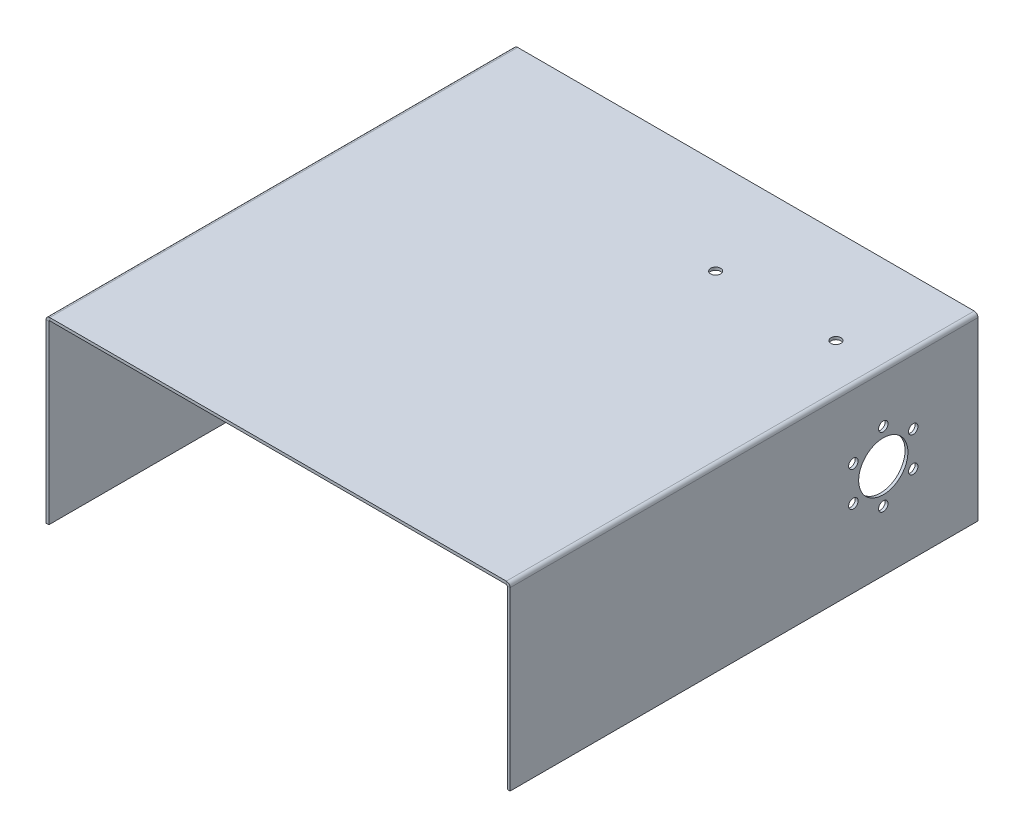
ISO-10303-21;
HEADER;
FILE_DESCRIPTION(('STEP AP214'),'2;1');
FILE_NAME('part.step','',(''),(''),'','','');
FILE_SCHEMA(('AUTOMOTIVE_DESIGN { 1 0 10303 214 1 1 1 1 }'));
ENDSEC;
DATA;
#1=APPLICATION_CONTEXT('core data for automotive mechanical design processes');
#2=APPLICATION_PROTOCOL_DEFINITION('international standard','automotive_design',2000,#1);
#3=PRODUCT_CONTEXT('',#1,'mechanical');
#4=PRODUCT('Part','Part','',(#3));
#5=PRODUCT_RELATED_PRODUCT_CATEGORY('part','',(#4));
#6=PRODUCT_DEFINITION_FORMATION('','',#4);
#7=PRODUCT_DEFINITION_CONTEXT('part definition',#1,'design');
#8=PRODUCT_DEFINITION('design','',#6,#7);
#9=PRODUCT_DEFINITION_SHAPE('','',#8);
#10=(LENGTH_UNIT() NAMED_UNIT(*) SI_UNIT(.MILLI.,.METRE.));
#11=(NAMED_UNIT(*) PLANE_ANGLE_UNIT() SI_UNIT($,.RADIAN.));
#12=(NAMED_UNIT(*) SI_UNIT($,.STERADIAN.) SOLID_ANGLE_UNIT());
#13=UNCERTAINTY_MEASURE_WITH_UNIT(LENGTH_MEASURE(1.E-05),#10,'distance_accuracy_value','');
#14=(GEOMETRIC_REPRESENTATION_CONTEXT(3) GLOBAL_UNCERTAINTY_ASSIGNED_CONTEXT((#13)) GLOBAL_UNIT_ASSIGNED_CONTEXT((#10,
#11,#12)) REPRESENTATION_CONTEXT('',''));
#15=CARTESIAN_POINT('',(0.,0.,0.));
#16=DIRECTION('',(0.,0.,1.));
#17=DIRECTION('',(1.,0.,0.));
#18=AXIS2_PLACEMENT_3D('',#15,#16,#17);
#19=CARTESIAN_POINT('',(-4.,190.,-494.));
#20=DIRECTION('',(0.,0.,-1.));
#21=DIRECTION('',(-1.,0.,0.));
#22=AXIS2_PLACEMENT_3D('',#19,#20,#21);
#23=PLANE('',#22);
#24=DIRECTION('',(0.,-1.,0.));
#25=VECTOR('',#24,1.);
#26=CARTESIAN_POINT('',(-4.,190.,-494.));
#27=LINE('',#26,#25);
#28=CARTESIAN_POINT('',(-4.,190.,-494.));
#29=VERTEX_POINT('',#28);
#30=CARTESIAN_POINT('',(-4.,187.,-494.));
#31=VERTEX_POINT('',#30);
#32=EDGE_CURVE('E11',#29,#31,#27,.T.);
#33=ORIENTED_EDGE('',*,*,#32,.F.);
#34=CARTESIAN_POINT('',(-4.,186.,-494.));
#35=DIRECTION('',(0.,0.,-1.));
#36=DIRECTION('',(-1.,0.,0.));
#37=AXIS2_PLACEMENT_3D('',#34,#35,#36);
#38=CIRCLE('',#37,4.);
#39=CARTESIAN_POINT('',(0.,186.,-494.));
#40=VERTEX_POINT('',#39);
#41=EDGE_CURVE('E204',#40,#29,#38,.F.);
#42=ORIENTED_EDGE('',*,*,#41,.F.);
#43=DIRECTION('',(1.,0.,0.));
#44=VECTOR('',#43,1.);
#45=CARTESIAN_POINT('',(-3.,186.,-494.));
#46=LINE('',#45,#44);
#47=CARTESIAN_POINT('',(-3.,186.,-494.));
#48=VERTEX_POINT('',#47);
#49=EDGE_CURVE('E41',#48,#40,#46,.T.);
#50=ORIENTED_EDGE('',*,*,#49,.F.);
#51=CARTESIAN_POINT('',(-4.,186.,-494.));
#52=DIRECTION('',(0.,0.,1.));
#53=DIRECTION('',(1.,0.,0.));
#54=AXIS2_PLACEMENT_3D('',#51,#52,#53);
#55=CIRCLE('',#54,1.);
#56=EDGE_CURVE('E193',#48,#31,#55,.T.);
#57=ORIENTED_EDGE('',*,*,#56,.T.);
#58=EDGE_LOOP('',(#33,#42,#50,#57));
#59=FACE_BOUND('',#58,.T.);
#60=ADVANCED_FACE('F33',(#59),#23,.T.);
#61=CARTESIAN_POINT('',(-3.,186.,-494.));
#62=DIRECTION('',(0.,0.,-1.));
#63=DIRECTION('',(-1.,0.,0.));
#64=AXIS2_PLACEMENT_3D('',#61,#62,#63);
#65=PLANE('',#64);
#66=DIRECTION('',(-1.,0.,0.));
#67=VECTOR('',#66,1.);
#68=CARTESIAN_POINT('',(0.,190.,-494.));
#69=LINE('',#68,#67);
#70=CARTESIAN_POINT('',(-486.,190.,-494.));
#71=VERTEX_POINT('',#70);
#72=EDGE_CURVE('E207',#29,#71,#69,.T.);
#73=ORIENTED_EDGE('',*,*,#72,.F.);
#74=ORIENTED_EDGE('',*,*,#32,.T.);
#75=DIRECTION('',(-1.,0.,0.));
#76=VECTOR('',#75,1.);
#77=CARTESIAN_POINT('',(0.,187.,-494.));
#78=LINE('',#77,#76);
#79=CARTESIAN_POINT('',(-486.,187.,-494.));
#80=VERTEX_POINT('',#79);
#81=EDGE_CURVE('E191',#31,#80,#78,.T.);
#82=ORIENTED_EDGE('',*,*,#81,.T.);
#83=DIRECTION('',(0.,1.,0.));
#84=VECTOR('',#83,1.);
#85=CARTESIAN_POINT('',(-486.,187.,-494.));
#86=LINE('',#85,#84);
#87=EDGE_CURVE('E57',#80,#71,#86,.T.);
#88=ORIENTED_EDGE('',*,*,#87,.T.);
#89=EDGE_LOOP('',(#73,#74,#82,#88));
#90=FACE_BOUND('',#89,.T.);
#91=ADVANCED_FACE('F344',(#90),#65,.T.);
#92=CARTESIAN_POINT('',(0.,186.,0.));
#93=DIRECTION('',(0.,0.,1.));
#94=DIRECTION('',(1.,0.,0.));
#95=AXIS2_PLACEMENT_3D('',#92,#93,#94);
#96=PLANE('',#95);
#97=DIRECTION('',(-1.,0.,0.));
#98=VECTOR('',#97,1.);
#99=CARTESIAN_POINT('',(0.,186.,0.));
#100=LINE('',#99,#98);
#101=CARTESIAN_POINT('',(0.,186.,0.));
#102=VERTEX_POINT('',#101);
#103=CARTESIAN_POINT('',(-3.,186.,0.));
#104=VERTEX_POINT('',#103);
#105=EDGE_CURVE('E248',#102,#104,#100,.T.);
#106=ORIENTED_EDGE('',*,*,#105,.F.);
#107=CARTESIAN_POINT('',(-4.,186.,0.));
#108=DIRECTION('',(0.,0.,-1.));
#109=DIRECTION('',(-1.,0.,0.));
#110=AXIS2_PLACEMENT_3D('',#107,#108,#109);
#111=CIRCLE('',#110,4.);
#112=CARTESIAN_POINT('',(-4.,190.,0.));
#113=VERTEX_POINT('',#112);
#114=EDGE_CURVE('E176',#102,#113,#111,.F.);
#115=ORIENTED_EDGE('',*,*,#114,.T.);
#116=DIRECTION('',(0.,1.,0.));
#117=VECTOR('',#116,1.);
#118=CARTESIAN_POINT('',(-4.,187.,0.));
#119=LINE('',#118,#117);
#120=CARTESIAN_POINT('',(-4.,187.,0.));
#121=VERTEX_POINT('',#120);
#122=EDGE_CURVE('E246',#121,#113,#119,.T.);
#123=ORIENTED_EDGE('',*,*,#122,.F.);
#124=CARTESIAN_POINT('',(-4.,186.,0.));
#125=DIRECTION('',(0.,0.,1.));
#126=DIRECTION('',(1.,0.,0.));
#127=AXIS2_PLACEMENT_3D('',#124,#125,#126);
#128=CIRCLE('',#127,1.);
#129=EDGE_CURVE('E165',#104,#121,#128,.T.);
#130=ORIENTED_EDGE('',*,*,#129,.F.);
#131=EDGE_LOOP('',(#106,#115,#123,#130));
#132=FACE_BOUND('',#131,.T.);
#133=ADVANCED_FACE('F346',(#132),#96,.T.);
#134=CARTESIAN_POINT('',(-4.,187.,0.));
#135=DIRECTION('',(0.,0.,1.));
#136=DIRECTION('',(1.,0.,0.));
#137=AXIS2_PLACEMENT_3D('',#134,#135,#136);
#138=PLANE('',#137);
#139=DIRECTION('',(0.,1.,0.));
#140=VECTOR('',#139,1.);
#141=CARTESIAN_POINT('',(0.,0.,0.));
#142=LINE('',#141,#140);
#143=CARTESIAN_POINT('',(0.,0.,0.));
#144=VERTEX_POINT('',#143);
#145=EDGE_CURVE('E173',#144,#102,#142,.T.);
#146=ORIENTED_EDGE('',*,*,#145,.T.);
#147=ORIENTED_EDGE('',*,*,#105,.T.);
#148=DIRECTION('',(0.,1.,0.));
#149=VECTOR('',#148,1.);
#150=CARTESIAN_POINT('',(-3.,0.,0.));
#151=LINE('',#150,#149);
#152=CARTESIAN_POINT('',(-3.,0.,0.));
#153=VERTEX_POINT('',#152);
#154=EDGE_CURVE('E168',#153,#104,#151,.T.);
#155=ORIENTED_EDGE('',*,*,#154,.F.);
#156=DIRECTION('',(-1.,0.,0.));
#157=VECTOR('',#156,1.);
#158=CARTESIAN_POINT('',(0.,0.,0.));
#159=LINE('',#158,#157);
#160=EDGE_CURVE('E171',#144,#153,#159,.T.);
#161=ORIENTED_EDGE('',*,*,#160,.F.);
#162=EDGE_LOOP('',(#146,#147,#155,#161));
#163=FACE_BOUND('',#162,.T.);
#164=ADVANCED_FACE('F324',(#163),#138,.T.);
#165=CARTESIAN_POINT('',(-490.,186.,-494.));
#166=DIRECTION('',(0.,0.,-1.));
#167=DIRECTION('',(-1.,0.,0.));
#168=AXIS2_PLACEMENT_3D('',#165,#166,#167);
#169=PLANE('',#168);
#170=DIRECTION('',(1.,0.,0.));
#171=VECTOR('',#170,1.);
#172=CARTESIAN_POINT('',(-490.,186.,-494.));
#173=LINE('',#172,#171);
#174=CARTESIAN_POINT('',(-490.,186.,-494.));
#175=VERTEX_POINT('',#174);
#176=CARTESIAN_POINT('',(-487.,186.,-494.));
#177=VERTEX_POINT('',#176);
#178=EDGE_CURVE('E49',#175,#177,#173,.T.);
#179=ORIENTED_EDGE('',*,*,#178,.F.);
#180=CARTESIAN_POINT('',(-486.,186.,-494.));
#181=DIRECTION('',(0.,0.,-1.));
#182=DIRECTION('',(-1.,0.,0.));
#183=AXIS2_PLACEMENT_3D('',#180,#181,#182);
#184=CIRCLE('',#183,4.);
#185=EDGE_CURVE('E136',#71,#175,#184,.F.);
#186=ORIENTED_EDGE('',*,*,#185,.F.);
#187=ORIENTED_EDGE('',*,*,#87,.F.);
#188=CARTESIAN_POINT('',(-486.,186.,-494.));
#189=DIRECTION('',(0.,0.,1.));
#190=DIRECTION('',(1.,0.,0.));
#191=AXIS2_PLACEMENT_3D('',#188,#189,#190);
#192=CIRCLE('',#191,1.);
#193=EDGE_CURVE('E189',#80,#177,#192,.T.);
#194=ORIENTED_EDGE('',*,*,#193,.T.);
#195=EDGE_LOOP('',(#179,#186,#187,#194));
#196=FACE_BOUND('',#195,.T.);
#197=ADVANCED_FACE('F356',(#196),#169,.T.);
#198=CARTESIAN_POINT('',(-486.,187.,-494.));
#199=DIRECTION('',(0.,0.,-1.));
#200=DIRECTION('',(-1.,0.,0.));
#201=AXIS2_PLACEMENT_3D('',#198,#199,#200);
#202=PLANE('',#201);
#203=DIRECTION('',(0.,-1.,0.));
#204=VECTOR('',#203,1.);
#205=CARTESIAN_POINT('',(-490.,190.,-494.));
#206=LINE('',#205,#204);
#207=CARTESIAN_POINT('',(-490.,0.,-494.));
#208=VERTEX_POINT('',#207);
#209=EDGE_CURVE('E132',#175,#208,#206,.T.);
#210=ORIENTED_EDGE('',*,*,#209,.F.);
#211=ORIENTED_EDGE('',*,*,#178,.T.);
#212=DIRECTION('',(0.,1.,0.));
#213=VECTOR('',#212,1.);
#214=CARTESIAN_POINT('',(-487.,190.,-494.));
#215=LINE('',#214,#213);
#216=CARTESIAN_POINT('',(-487.,0.,-494.));
#217=VERTEX_POINT('',#216);
#218=EDGE_CURVE('E187',#177,#217,#215,.F.);
#219=ORIENTED_EDGE('',*,*,#218,.T.);
#220=DIRECTION('',(-1.,0.,0.));
#221=VECTOR('',#220,1.);
#222=CARTESIAN_POINT('',(-487.,0.,-494.));
#223=LINE('',#222,#221);
#224=EDGE_CURVE('E185',#217,#208,#223,.T.);
#225=ORIENTED_EDGE('',*,*,#224,.T.);
#226=EDGE_LOOP('',(#210,#211,#219,#225));
#227=FACE_BOUND('',#226,.T.);
#228=ADVANCED_FACE('F359',(#227),#202,.T.);
#229=CARTESIAN_POINT('',(-486.,190.,0.));
#230=DIRECTION('',(0.,0.,1.));
#231=DIRECTION('',(1.,0.,0.));
#232=AXIS2_PLACEMENT_3D('',#229,#230,#231);
#233=PLANE('',#232);
#234=DIRECTION('',(0.,-1.,0.));
#235=VECTOR('',#234,1.);
#236=CARTESIAN_POINT('',(-486.,190.,0.));
#237=LINE('',#236,#235);
#238=CARTESIAN_POINT('',(-486.,190.,0.));
#239=VERTEX_POINT('',#238);
#240=CARTESIAN_POINT('',(-486.,187.,0.));
#241=VERTEX_POINT('',#240);
#242=EDGE_CURVE('E242',#239,#241,#237,.T.);
#243=ORIENTED_EDGE('',*,*,#242,.F.);
#244=CARTESIAN_POINT('',(-486.,186.,0.));
#245=DIRECTION('',(0.,0.,-1.));
#246=DIRECTION('',(-1.,0.,0.));
#247=AXIS2_PLACEMENT_3D('',#244,#245,#246);
#248=CIRCLE('',#247,4.);
#249=CARTESIAN_POINT('',(-490.,186.,0.));
#250=VERTEX_POINT('',#249);
#251=EDGE_CURVE('E182',#239,#250,#248,.F.);
#252=ORIENTED_EDGE('',*,*,#251,.T.);
#253=DIRECTION('',(-1.,0.,0.));
#254=VECTOR('',#253,1.);
#255=CARTESIAN_POINT('',(-487.,186.,0.));
#256=LINE('',#255,#254);
#257=CARTESIAN_POINT('',(-487.,186.,0.));
#258=VERTEX_POINT('',#257);
#259=EDGE_CURVE('E148',#258,#250,#256,.T.);
#260=ORIENTED_EDGE('',*,*,#259,.F.);
#261=CARTESIAN_POINT('',(-486.,186.,0.));
#262=DIRECTION('',(0.,0.,1.));
#263=DIRECTION('',(1.,0.,0.));
#264=AXIS2_PLACEMENT_3D('',#261,#262,#263);
#265=CIRCLE('',#264,1.);
#266=EDGE_CURVE('E159',#241,#258,#265,.T.);
#267=ORIENTED_EDGE('',*,*,#266,.F.);
#268=EDGE_LOOP('',(#243,#252,#260,#267));
#269=FACE_BOUND('',#268,.T.);
#270=ADVANCED_FACE('F362',(#269),#233,.T.);
#271=CARTESIAN_POINT('',(-487.,186.,0.));
#272=DIRECTION('',(0.,0.,1.));
#273=DIRECTION('',(1.,0.,0.));
#274=AXIS2_PLACEMENT_3D('',#271,#272,#273);
#275=PLANE('',#274);
#276=DIRECTION('',(-1.,0.,0.));
#277=VECTOR('',#276,1.);
#278=CARTESIAN_POINT('',(0.,190.,0.));
#279=LINE('',#278,#277);
#280=EDGE_CURVE('E179',#113,#239,#279,.T.);
#281=ORIENTED_EDGE('',*,*,#280,.T.);
#282=ORIENTED_EDGE('',*,*,#242,.T.);
#283=DIRECTION('',(-1.,0.,0.));
#284=VECTOR('',#283,1.);
#285=CARTESIAN_POINT('',(0.,187.,0.));
#286=LINE('',#285,#284);
#287=EDGE_CURVE('E162',#121,#241,#286,.T.);
#288=ORIENTED_EDGE('',*,*,#287,.F.);
#289=ORIENTED_EDGE('',*,*,#122,.T.);
#290=EDGE_LOOP('',(#281,#282,#288,#289));
#291=FACE_BOUND('',#290,.T.);
#292=ADVANCED_FACE('F366',(#291),#275,.T.);
#293=CARTESIAN_POINT('',(-490.,190.,-494.));
#294=DIRECTION('',(-1.,0.,0.));
#295=DIRECTION('',(0.,0.,1.));
#296=AXIS2_PLACEMENT_3D('',#293,#294,#295);
#297=PLANE('',#296);
#298=CARTESIAN_POINT('',(-490.,99.9999999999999,-394.));
#299=DIRECTION('',(-1.,0.,0.));
#300=DIRECTION('',(0.,0.,1.));
#301=AXIS2_PLACEMENT_3D('',#298,#299,#300);
#302=CIRCLE('',#301,15.);
#303=CARTESIAN_POINT('',(-490.,99.9999999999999,-379.));
#304=VERTEX_POINT('',#303);
#305=EDGE_CURVE('E290',#304,#304,#302,.T.);
#306=ORIENTED_EDGE('',*,*,#305,.F.);
#307=EDGE_LOOP('',(#306));
#308=FACE_BOUND('',#307,.T.);
#309=DIRECTION('',(0.,-1.,0.));
#310=VECTOR('',#309,1.);
#311=CARTESIAN_POINT('',(-490.,190.,0.));
#312=LINE('',#311,#310);
#313=CARTESIAN_POINT('',(-490.,0.,0.));
#314=VERTEX_POINT('',#313);
#315=EDGE_CURVE('E129',#250,#314,#312,.T.);
#316=ORIENTED_EDGE('',*,*,#315,.F.);
#317=DIRECTION('',(0.,0.,1.));
#318=VECTOR('',#317,1.);
#319=CARTESIAN_POINT('',(-490.,186.,-494.));
#320=LINE('',#319,#318);
#321=EDGE_CURVE('E212',#175,#250,#320,.T.);
#322=ORIENTED_EDGE('',*,*,#321,.F.);
#323=ORIENTED_EDGE('',*,*,#209,.T.);
#324=DIRECTION('',(0.,0.,1.));
#325=VECTOR('',#324,1.);
#326=CARTESIAN_POINT('',(-490.,0.,-494.));
#327=LINE('',#326,#325);
#328=EDGE_CURVE('E125',#208,#314,#327,.T.);
#329=ORIENTED_EDGE('',*,*,#328,.T.);
#330=EDGE_LOOP('',(#316,#322,#323,#329));
#331=FACE_BOUND('',#330,.T.);
#332=ADVANCED_FACE('F127',(#308,#331),#297,.T.);
#333=CARTESIAN_POINT('',(-486.,186.,-494.));
#334=DIRECTION('',(0.,0.,1.));
#335=DIRECTION('',(1.,0.,0.));
#336=AXIS2_PLACEMENT_3D('',#333,#334,#335);
#337=CYLINDRICAL_SURFACE('',#336,4.);
#338=ORIENTED_EDGE('',*,*,#251,.F.);
#339=DIRECTION('',(0.,0.,1.));
#340=VECTOR('',#339,1.);
#341=CARTESIAN_POINT('',(-486.,190.,-494.));
#342=LINE('',#341,#340);
#343=EDGE_CURVE('E214',#71,#239,#342,.T.);
#344=ORIENTED_EDGE('',*,*,#343,.F.);
#345=ORIENTED_EDGE('',*,*,#185,.T.);
#346=ORIENTED_EDGE('',*,*,#321,.T.);
#347=EDGE_LOOP('',(#338,#344,#345,#346));
#348=FACE_BOUND('',#347,.T.);
#349=ADVANCED_FACE('F373',(#348),#337,.T.);
#350=CARTESIAN_POINT('',(0.,190.,-494.));
#351=DIRECTION('',(0.,1.,0.));
#352=DIRECTION('',(-1.,0.,0.));
#353=AXIS2_PLACEMENT_3D('',#350,#351,#352);
#354=PLANE('',#353);
#355=CARTESIAN_POINT('',(-177.,190.,-394.));
#356=DIRECTION('',(0.,1.,0.));
#357=DIRECTION('',(-1.,0.,0.));
#358=AXIS2_PLACEMENT_3D('',#355,#356,#357);
#359=CIRCLE('',#358,5.25);
#360=CARTESIAN_POINT('',(-182.25,190.,-394.));
#361=VERTEX_POINT('',#360);
#362=EDGE_CURVE('E280',#361,#361,#359,.T.);
#363=ORIENTED_EDGE('',*,*,#362,.F.);
#364=EDGE_LOOP('',(#363));
#365=FACE_BOUND('',#364,.T.);
#366=CARTESIAN_POINT('',(-50.,190.,-394.));
#367=DIRECTION('',(0.,1.,0.));
#368=DIRECTION('',(-1.,0.,0.));
#369=AXIS2_PLACEMENT_3D('',#366,#367,#368);
#370=CIRCLE('',#369,5.25);
#371=CARTESIAN_POINT('',(-55.25,190.,-394.));
#372=VERTEX_POINT('',#371);
#373=EDGE_CURVE('E277',#372,#372,#370,.T.);
#374=ORIENTED_EDGE('',*,*,#373,.F.);
#375=EDGE_LOOP('',(#374));
#376=FACE_BOUND('',#375,.T.);
#377=ORIENTED_EDGE('',*,*,#280,.F.);
#378=DIRECTION('',(0.,0.,1.));
#379=VECTOR('',#378,1.);
#380=CARTESIAN_POINT('',(-4.,190.,-494.));
#381=LINE('',#380,#379);
#382=EDGE_CURVE('E217',#29,#113,#381,.T.);
#383=ORIENTED_EDGE('',*,*,#382,.F.);
#384=ORIENTED_EDGE('',*,*,#72,.T.);
#385=ORIENTED_EDGE('',*,*,#343,.T.);
#386=EDGE_LOOP('',(#377,#383,#384,#385));
#387=FACE_BOUND('',#386,.T.);
#388=ADVANCED_FACE('F343',(#365,#376,#387),#354,.T.);
#389=CARTESIAN_POINT('',(-4.,186.,-494.));
#390=DIRECTION('',(0.,0.,1.));
#391=DIRECTION('',(1.,0.,0.));
#392=AXIS2_PLACEMENT_3D('',#389,#390,#391);
#393=CYLINDRICAL_SURFACE('',#392,4.);
#394=ORIENTED_EDGE('',*,*,#114,.F.);
#395=DIRECTION('',(0.,0.,1.));
#396=VECTOR('',#395,1.);
#397=CARTESIAN_POINT('',(0.,186.,-494.));
#398=LINE('',#397,#396);
#399=EDGE_CURVE('E220',#40,#102,#398,.T.);
#400=ORIENTED_EDGE('',*,*,#399,.F.);
#401=ORIENTED_EDGE('',*,*,#41,.T.);
#402=ORIENTED_EDGE('',*,*,#382,.T.);
#403=EDGE_LOOP('',(#394,#400,#401,#402));
#404=FACE_BOUND('',#403,.T.);
#405=ADVANCED_FACE('F312',(#404),#393,.T.);
#406=CARTESIAN_POINT('',(0.,0.,-494.));
#407=DIRECTION('',(1.,0.,0.));
#408=DIRECTION('',(0.,0.,-1.));
#409=AXIS2_PLACEMENT_3D('',#406,#407,#408);
#410=PLANE('',#409);
#411=CARTESIAN_POINT('',(0.,118.249999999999,-362.390072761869));
#412=DIRECTION('',(1.,0.,0.));
#413=DIRECTION('',(0.,0.,-1.));
#414=AXIS2_PLACEMENT_3D('',#411,#412,#413);
#415=CIRCLE('',#414,5.);
#416=CARTESIAN_POINT('',(0.,118.249999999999,-367.390072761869));
#417=VERTEX_POINT('',#416);
#418=EDGE_CURVE('E274',#417,#417,#415,.T.);
#419=ORIENTED_EDGE('',*,*,#418,.F.);
#420=EDGE_LOOP('',(#419));
#421=FACE_BOUND('',#420,.T.);
#422=CARTESIAN_POINT('',(0.,81.749999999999,-362.39007276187));
#423=DIRECTION('',(1.,0.,0.));
#424=DIRECTION('',(0.,0.,-1.));
#425=AXIS2_PLACEMENT_3D('',#422,#423,#424);
#426=CIRCLE('',#425,5.00000000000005);
#427=CARTESIAN_POINT('',(0.,81.749999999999,-367.39007276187));
#428=VERTEX_POINT('',#427);
#429=EDGE_CURVE('E270',#428,#428,#426,.T.);
#430=ORIENTED_EDGE('',*,*,#429,.F.);
#431=EDGE_LOOP('',(#430));
#432=FACE_BOUND('',#431,.T.);
#433=CARTESIAN_POINT('',(0.,63.5,-394.000000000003));
#434=DIRECTION('',(1.,0.,0.));
#435=DIRECTION('',(0.,0.,-1.));
#436=AXIS2_PLACEMENT_3D('',#433,#434,#435);
#437=CIRCLE('',#436,4.99999999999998);
#438=CARTESIAN_POINT('',(0.,63.5,-399.000000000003));
#439=VERTEX_POINT('',#438);
#440=EDGE_CURVE('E266',#439,#439,#437,.T.);
#441=ORIENTED_EDGE('',*,*,#440,.F.);
#442=EDGE_LOOP('',(#441));
#443=FACE_BOUND('',#442,.T.);
#444=CARTESIAN_POINT('',(0.,81.7500000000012,-425.609927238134));
#445=DIRECTION('',(1.,0.,0.));
#446=DIRECTION('',(0.,0.,-1.));
#447=AXIS2_PLACEMENT_3D('',#444,#445,#446);
#448=CIRCLE('',#447,5.00000000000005);
#449=CARTESIAN_POINT('',(0.,81.7500000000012,-430.609927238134));
#450=VERTEX_POINT('',#449);
#451=EDGE_CURVE('E262',#450,#450,#448,.T.);
#452=ORIENTED_EDGE('',*,*,#451,.F.);
#453=EDGE_LOOP('',(#452));
#454=FACE_BOUND('',#453,.T.);
#455=CARTESIAN_POINT('',(0.,118.250000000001,-425.609927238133));
#456=DIRECTION('',(1.,0.,0.));
#457=DIRECTION('',(0.,0.,-1.));
#458=AXIS2_PLACEMENT_3D('',#455,#456,#457);
#459=CIRCLE('',#458,5.00000000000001);
#460=CARTESIAN_POINT('',(0.,118.250000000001,-430.609927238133));
#461=VERTEX_POINT('',#460);
#462=EDGE_CURVE('E258',#461,#461,#459,.T.);
#463=ORIENTED_EDGE('',*,*,#462,.F.);
#464=EDGE_LOOP('',(#463));
#465=FACE_BOUND('',#464,.T.);
#466=CARTESIAN_POINT('',(0.,136.5,-394.));
#467=DIRECTION('',(1.,0.,0.));
#468=DIRECTION('',(0.,0.,-1.));
#469=AXIS2_PLACEMENT_3D('',#466,#467,#468);
#470=CIRCLE('',#469,4.99999999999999);
#471=CARTESIAN_POINT('',(0.,136.5,-399.));
#472=VERTEX_POINT('',#471);
#473=EDGE_CURVE('E254',#472,#472,#470,.T.);
#474=ORIENTED_EDGE('',*,*,#473,.F.);
#475=EDGE_LOOP('',(#474));
#476=FACE_BOUND('',#475,.T.);
#477=CARTESIAN_POINT('',(0.,100.,-394.));
#478=DIRECTION('',(1.,0.,0.));
#479=DIRECTION('',(0.,0.,-1.));
#480=AXIS2_PLACEMENT_3D('',#477,#478,#479);
#481=CIRCLE('',#480,26.);
#482=CARTESIAN_POINT('',(0.,100.,-420.));
#483=VERTEX_POINT('',#482);
#484=EDGE_CURVE('E153',#483,#483,#481,.T.);
#485=ORIENTED_EDGE('',*,*,#484,.F.);
#486=EDGE_LOOP('',(#485));
#487=FACE_BOUND('',#486,.T.);
#488=ORIENTED_EDGE('',*,*,#145,.F.);
#489=DIRECTION('',(0.,0.,1.));
#490=VECTOR('',#489,1.);
#491=CARTESIAN_POINT('',(0.,0.,-494.));
#492=LINE('',#491,#490);
#493=CARTESIAN_POINT('',(0.,0.,-494.));
#494=VERTEX_POINT('',#493);
#495=EDGE_CURVE('E223',#494,#144,#492,.T.);
#496=ORIENTED_EDGE('',*,*,#495,.F.);
#497=DIRECTION('',(0.,1.,0.));
#498=VECTOR('',#497,1.);
#499=CARTESIAN_POINT('',(0.,0.,-494.));
#500=LINE('',#499,#498);
#501=EDGE_CURVE('E201',#494,#40,#500,.T.);
#502=ORIENTED_EDGE('',*,*,#501,.T.);
#503=ORIENTED_EDGE('',*,*,#399,.T.);
#504=EDGE_LOOP('',(#488,#496,#502,#503));
#505=FACE_BOUND('',#504,.T.);
#506=ADVANCED_FACE('F308',(#421,#432,#443,#454,#465,#476,#487,#505),#410,.T.);
#507=CARTESIAN_POINT('',(0.,0.,-494.));
#508=DIRECTION('',(0.,1.,0.));
#509=DIRECTION('',(0.,0.,1.));
#510=AXIS2_PLACEMENT_3D('',#507,#508,#509);
#511=PLANE('',#510);
#512=ORIENTED_EDGE('',*,*,#160,.T.);
#513=DIRECTION('',(0.,0.,1.));
#514=VECTOR('',#513,1.);
#515=CARTESIAN_POINT('',(-3.,0.,-494.));
#516=LINE('',#515,#514);
#517=CARTESIAN_POINT('',(-3.,0.,-494.));
#518=VERTEX_POINT('',#517);
#519=EDGE_CURVE('E225',#518,#153,#516,.T.);
#520=ORIENTED_EDGE('',*,*,#519,.F.);
#521=DIRECTION('',(-1.,0.,0.));
#522=VECTOR('',#521,1.);
#523=CARTESIAN_POINT('',(0.,0.,-494.));
#524=LINE('',#523,#522);
#525=EDGE_CURVE('E199',#494,#518,#524,.T.);
#526=ORIENTED_EDGE('',*,*,#525,.F.);
#527=ORIENTED_EDGE('',*,*,#495,.T.);
#528=EDGE_LOOP('',(#512,#520,#526,#527));
#529=FACE_BOUND('',#528,.T.);
#530=ADVANCED_FACE('F311',(#529),#511,.F.);
#531=CARTESIAN_POINT('',(-3.,0.,-494.));
#532=DIRECTION('',(1.,0.,0.));
#533=DIRECTION('',(0.,0.,-1.));
#534=AXIS2_PLACEMENT_3D('',#531,#532,#533);
#535=PLANE('',#534);
#536=CARTESIAN_POINT('',(-3.,118.249999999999,-362.390072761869));
#537=DIRECTION('',(1.,0.,0.));
#538=DIRECTION('',(0.,0.,-1.));
#539=AXIS2_PLACEMENT_3D('',#536,#537,#538);
#540=CIRCLE('',#539,5.);
#541=CARTESIAN_POINT('',(-3.,118.249999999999,-367.390072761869));
#542=VERTEX_POINT('',#541);
#543=EDGE_CURVE('E271',#542,#542,#540,.T.);
#544=ORIENTED_EDGE('',*,*,#543,.T.);
#545=EDGE_LOOP('',(#544));
#546=FACE_BOUND('',#545,.T.);
#547=CARTESIAN_POINT('',(-3.,81.749999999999,-362.39007276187));
#548=DIRECTION('',(1.,0.,0.));
#549=DIRECTION('',(0.,0.,-1.));
#550=AXIS2_PLACEMENT_3D('',#547,#548,#549);
#551=CIRCLE('',#550,5.00000000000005);
#552=CARTESIAN_POINT('',(-3.,81.749999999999,-367.39007276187));
#553=VERTEX_POINT('',#552);
#554=EDGE_CURVE('E267',#553,#553,#551,.T.);
#555=ORIENTED_EDGE('',*,*,#554,.T.);
#556=EDGE_LOOP('',(#555));
#557=FACE_BOUND('',#556,.T.);
#558=CARTESIAN_POINT('',(-3.,63.5,-394.000000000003));
#559=DIRECTION('',(1.,0.,0.));
#560=DIRECTION('',(0.,0.,-1.));
#561=AXIS2_PLACEMENT_3D('',#558,#559,#560);
#562=CIRCLE('',#561,4.99999999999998);
#563=CARTESIAN_POINT('',(-3.,63.5,-399.000000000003));
#564=VERTEX_POINT('',#563);
#565=EDGE_CURVE('E263',#564,#564,#562,.T.);
#566=ORIENTED_EDGE('',*,*,#565,.T.);
#567=EDGE_LOOP('',(#566));
#568=FACE_BOUND('',#567,.T.);
#569=CARTESIAN_POINT('',(-3.,81.7500000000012,-425.609927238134));
#570=DIRECTION('',(1.,0.,0.));
#571=DIRECTION('',(0.,0.,-1.));
#572=AXIS2_PLACEMENT_3D('',#569,#570,#571);
#573=CIRCLE('',#572,5.00000000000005);
#574=CARTESIAN_POINT('',(-3.,81.7500000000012,-430.609927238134));
#575=VERTEX_POINT('',#574);
#576=EDGE_CURVE('E259',#575,#575,#573,.T.);
#577=ORIENTED_EDGE('',*,*,#576,.T.);
#578=EDGE_LOOP('',(#577));
#579=FACE_BOUND('',#578,.T.);
#580=CARTESIAN_POINT('',(-3.,118.250000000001,-425.609927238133));
#581=DIRECTION('',(1.,0.,0.));
#582=DIRECTION('',(0.,0.,-1.));
#583=AXIS2_PLACEMENT_3D('',#580,#581,#582);
#584=CIRCLE('',#583,5.00000000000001);
#585=CARTESIAN_POINT('',(-3.,118.250000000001,-430.609927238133));
#586=VERTEX_POINT('',#585);
#587=EDGE_CURVE('E255',#586,#586,#584,.T.);
#588=ORIENTED_EDGE('',*,*,#587,.T.);
#589=EDGE_LOOP('',(#588));
#590=FACE_BOUND('',#589,.T.);
#591=CARTESIAN_POINT('',(-3.,136.5,-394.));
#592=DIRECTION('',(1.,0.,0.));
#593=DIRECTION('',(0.,0.,-1.));
#594=AXIS2_PLACEMENT_3D('',#591,#592,#593);
#595=CIRCLE('',#594,4.99999999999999);
#596=CARTESIAN_POINT('',(-3.,136.5,-399.));
#597=VERTEX_POINT('',#596);
#598=EDGE_CURVE('E251',#597,#597,#595,.T.);
#599=ORIENTED_EDGE('',*,*,#598,.T.);
#600=EDGE_LOOP('',(#599));
#601=FACE_BOUND('',#600,.T.);
#602=CARTESIAN_POINT('',(-3.,100.,-394.));
#603=DIRECTION('',(1.,0.,0.));
#604=DIRECTION('',(0.,0.,-1.));
#605=AXIS2_PLACEMENT_3D('',#602,#603,#604);
#606=CIRCLE('',#605,26.);
#607=CARTESIAN_POINT('',(-3.,100.,-420.));
#608=VERTEX_POINT('',#607);
#609=EDGE_CURVE('E150',#608,#608,#606,.T.);
#610=ORIENTED_EDGE('',*,*,#609,.T.);
#611=EDGE_LOOP('',(#610));
#612=FACE_BOUND('',#611,.T.);
#613=ORIENTED_EDGE('',*,*,#154,.T.);
#614=DIRECTION('',(0.,0.,1.));
#615=VECTOR('',#614,1.);
#616=CARTESIAN_POINT('',(-3.,186.,-494.));
#617=LINE('',#616,#615);
#618=EDGE_CURVE('E228',#48,#104,#617,.T.);
#619=ORIENTED_EDGE('',*,*,#618,.F.);
#620=DIRECTION('',(0.,1.,0.));
#621=VECTOR('',#620,1.);
#622=CARTESIAN_POINT('',(-3.,0.,-494.));
#623=LINE('',#622,#621);
#624=EDGE_CURVE('E196',#518,#48,#623,.T.);
#625=ORIENTED_EDGE('',*,*,#624,.F.);
#626=ORIENTED_EDGE('',*,*,#519,.T.);
#627=EDGE_LOOP('',(#613,#619,#625,#626));
#628=FACE_BOUND('',#627,.T.);
#629=ADVANCED_FACE('F330',(#546,#557,#568,#579,#590,#601,#612,#628),#535,.F.);
#630=CARTESIAN_POINT('',(-4.,186.,-494.));
#631=DIRECTION('',(0.,0.,1.));
#632=DIRECTION('',(1.,0.,0.));
#633=AXIS2_PLACEMENT_3D('',#630,#631,#632);
#634=CYLINDRICAL_SURFACE('',#633,1.);
#635=ORIENTED_EDGE('',*,*,#129,.T.);
#636=DIRECTION('',(0.,0.,1.));
#637=VECTOR('',#636,1.);
#638=CARTESIAN_POINT('',(-4.,187.,-494.));
#639=LINE('',#638,#637);
#640=EDGE_CURVE('E231',#31,#121,#639,.T.);
#641=ORIENTED_EDGE('',*,*,#640,.F.);
#642=ORIENTED_EDGE('',*,*,#56,.F.);
#643=ORIENTED_EDGE('',*,*,#618,.T.);
#644=EDGE_LOOP('',(#635,#641,#642,#643));
#645=FACE_BOUND('',#644,.T.);
#646=ADVANCED_FACE('F388',(#645),#634,.F.);
#647=CARTESIAN_POINT('',(0.,187.,-494.));
#648=DIRECTION('',(0.,1.,0.));
#649=DIRECTION('',(-1.,0.,0.));
#650=AXIS2_PLACEMENT_3D('',#647,#648,#649);
#651=PLANE('',#650);
#652=CARTESIAN_POINT('',(-177.,187.,-394.));
#653=DIRECTION('',(0.,1.,0.));
#654=DIRECTION('',(-1.,0.,0.));
#655=AXIS2_PLACEMENT_3D('',#652,#653,#654);
#656=CIRCLE('',#655,5.25);
#657=CARTESIAN_POINT('',(-182.25,187.,-394.));
#658=VERTEX_POINT('',#657);
#659=EDGE_CURVE('E278',#658,#658,#656,.T.);
#660=ORIENTED_EDGE('',*,*,#659,.T.);
#661=EDGE_LOOP('',(#660));
#662=FACE_BOUND('',#661,.T.);
#663=CARTESIAN_POINT('',(-50.,187.,-394.));
#664=DIRECTION('',(0.,1.,0.));
#665=DIRECTION('',(-1.,0.,0.));
#666=AXIS2_PLACEMENT_3D('',#663,#664,#665);
#667=CIRCLE('',#666,5.25);
#668=CARTESIAN_POINT('',(-55.25,187.,-394.));
#669=VERTEX_POINT('',#668);
#670=EDGE_CURVE('E275',#669,#669,#667,.T.);
#671=ORIENTED_EDGE('',*,*,#670,.T.);
#672=EDGE_LOOP('',(#671));
#673=FACE_BOUND('',#672,.T.);
#674=ORIENTED_EDGE('',*,*,#287,.T.);
#675=DIRECTION('',(0.,0.,1.));
#676=VECTOR('',#675,1.);
#677=CARTESIAN_POINT('',(-486.,187.,-494.));
#678=LINE('',#677,#676);
#679=EDGE_CURVE('E234',#80,#241,#678,.T.);
#680=ORIENTED_EDGE('',*,*,#679,.F.);
#681=ORIENTED_EDGE('',*,*,#81,.F.);
#682=ORIENTED_EDGE('',*,*,#640,.T.);
#683=EDGE_LOOP('',(#674,#680,#681,#682));
#684=FACE_BOUND('',#683,.T.);
#685=ADVANCED_FACE('F384',(#662,#673,#684),#651,.F.);
#686=CARTESIAN_POINT('',(-486.,186.,-494.));
#687=DIRECTION('',(0.,0.,1.));
#688=DIRECTION('',(1.,0.,0.));
#689=AXIS2_PLACEMENT_3D('',#686,#687,#688);
#690=CYLINDRICAL_SURFACE('',#689,1.);
#691=ORIENTED_EDGE('',*,*,#266,.T.);
#692=DIRECTION('',(0.,0.,1.));
#693=VECTOR('',#692,1.);
#694=CARTESIAN_POINT('',(-487.,186.,-494.));
#695=LINE('',#694,#693);
#696=EDGE_CURVE('E237',#177,#258,#695,.T.);
#697=ORIENTED_EDGE('',*,*,#696,.F.);
#698=ORIENTED_EDGE('',*,*,#193,.F.);
#699=ORIENTED_EDGE('',*,*,#679,.T.);
#700=EDGE_LOOP('',(#691,#697,#698,#699));
#701=FACE_BOUND('',#700,.T.);
#702=ADVANCED_FACE('F380',(#701),#690,.F.);
#703=CARTESIAN_POINT('',(-487.,190.,-494.));
#704=DIRECTION('',(-1.,0.,0.));
#705=DIRECTION('',(0.,0.,1.));
#706=AXIS2_PLACEMENT_3D('',#703,#704,#705);
#707=PLANE('',#706);
#708=CARTESIAN_POINT('',(-487.,99.9999999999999,-394.));
#709=DIRECTION('',(-1.,0.,0.));
#710=DIRECTION('',(0.,0.,1.));
#711=AXIS2_PLACEMENT_3D('',#708,#709,#710);
#712=CIRCLE('',#711,15.);
#713=CARTESIAN_POINT('',(-487.,99.9999999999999,-379.));
#714=VERTEX_POINT('',#713);
#715=EDGE_CURVE('E36',#714,#714,#712,.T.);
#716=ORIENTED_EDGE('',*,*,#715,.T.);
#717=EDGE_LOOP('',(#716));
#718=FACE_BOUND('',#717,.T.);
#719=DIRECTION('',(0.,1.,0.));
#720=VECTOR('',#719,1.);
#721=CARTESIAN_POINT('',(-487.,190.,0.));
#722=LINE('',#721,#720);
#723=CARTESIAN_POINT('',(-487.,0.,0.));
#724=VERTEX_POINT('',#723);
#725=EDGE_CURVE('E145',#258,#724,#722,.F.);
#726=ORIENTED_EDGE('',*,*,#725,.T.);
#727=DIRECTION('',(0.,0.,1.));
#728=VECTOR('',#727,1.);
#729=CARTESIAN_POINT('',(-487.,0.,-494.));
#730=LINE('',#729,#728);
#731=EDGE_CURVE('E135',#217,#724,#730,.T.);
#732=ORIENTED_EDGE('',*,*,#731,.F.);
#733=ORIENTED_EDGE('',*,*,#218,.F.);
#734=ORIENTED_EDGE('',*,*,#696,.T.);
#735=EDGE_LOOP('',(#726,#732,#733,#734));
#736=FACE_BOUND('',#735,.T.);
#737=ADVANCED_FACE('F377',(#718,#736),#707,.F.);
#738=CARTESIAN_POINT('',(-487.,0.,-494.));
#739=DIRECTION('',(0.,1.,0.));
#740=DIRECTION('',(-1.,0.,0.));
#741=AXIS2_PLACEMENT_3D('',#738,#739,#740);
#742=PLANE('',#741);
#743=DIRECTION('',(-1.,0.,0.));
#744=VECTOR('',#743,1.);
#745=CARTESIAN_POINT('',(-487.,0.,0.));
#746=LINE('',#745,#744);
#747=EDGE_CURVE('E140',#724,#314,#746,.T.);
#748=ORIENTED_EDGE('',*,*,#747,.T.);
#749=ORIENTED_EDGE('',*,*,#328,.F.);
#750=ORIENTED_EDGE('',*,*,#224,.F.);
#751=ORIENTED_EDGE('',*,*,#731,.T.);
#752=EDGE_LOOP('',(#748,#749,#750,#751));
#753=FACE_BOUND('',#752,.T.);
#754=ADVANCED_FACE('F141',(#753),#742,.F.);
#755=CARTESIAN_POINT('',(-486.,186.,-494.));
#756=DIRECTION('',(0.,0.,1.));
#757=DIRECTION('',(1.,0.,0.));
#758=AXIS2_PLACEMENT_3D('',#755,#756,#757);
#759=PLANE('',#758);
#760=ORIENTED_EDGE('',*,*,#624,.T.);
#761=ORIENTED_EDGE('',*,*,#49,.T.);
#762=ORIENTED_EDGE('',*,*,#501,.F.);
#763=ORIENTED_EDGE('',*,*,#525,.T.);
#764=EDGE_LOOP('',(#760,#761,#762,#763));
#765=FACE_BOUND('',#764,.T.);
#766=ADVANCED_FACE('F334',(#765),#759,.F.);
#767=CARTESIAN_POINT('',(-486.,186.,0.));
#768=DIRECTION('',(0.,0.,1.));
#769=DIRECTION('',(1.,0.,0.));
#770=AXIS2_PLACEMENT_3D('',#767,#768,#769);
#771=PLANE('',#770);
#772=ORIENTED_EDGE('',*,*,#315,.T.);
#773=ORIENTED_EDGE('',*,*,#747,.F.);
#774=ORIENTED_EDGE('',*,*,#725,.F.);
#775=ORIENTED_EDGE('',*,*,#259,.T.);
#776=EDGE_LOOP('',(#772,#773,#774,#775));
#777=FACE_BOUND('',#776,.T.);
#778=ADVANCED_FACE('F147',(#777),#771,.T.);
#779=CARTESIAN_POINT('',(-4.,100.,-394.));
#780=DIRECTION('',(1.,0.,0.));
#781=DIRECTION('',(0.,0.,-1.));
#782=AXIS2_PLACEMENT_3D('',#779,#780,#781);
#783=CYLINDRICAL_SURFACE('',#782,26.);
#784=ORIENTED_EDGE('',*,*,#484,.T.);
#785=EDGE_LOOP('',(#784));
#786=FACE_BOUND('',#785,.T.);
#787=ORIENTED_EDGE('',*,*,#609,.F.);
#788=EDGE_LOOP('',(#787));
#789=FACE_BOUND('',#788,.T.);
#790=ADVANCED_FACE('F409',(#786,#789),#783,.F.);
#791=CARTESIAN_POINT('',(-4.,136.5,-394.));
#792=DIRECTION('',(1.,0.,0.));
#793=DIRECTION('',(0.,0.,-1.));
#794=AXIS2_PLACEMENT_3D('',#791,#792,#793);
#795=CYLINDRICAL_SURFACE('',#794,4.99999999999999);
#796=ORIENTED_EDGE('',*,*,#473,.T.);
#797=EDGE_LOOP('',(#796));
#798=FACE_BOUND('',#797,.T.);
#799=ORIENTED_EDGE('',*,*,#598,.F.);
#800=EDGE_LOOP('',(#799));
#801=FACE_BOUND('',#800,.T.);
#802=ADVANCED_FACE('F305',(#798,#801),#795,.F.);
#803=CARTESIAN_POINT('',(-4.,118.250000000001,-425.609927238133));
#804=DIRECTION('',(1.,0.,0.));
#805=DIRECTION('',(0.,0.,-1.));
#806=AXIS2_PLACEMENT_3D('',#803,#804,#805);
#807=CYLINDRICAL_SURFACE('',#806,5.00000000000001);
#808=ORIENTED_EDGE('',*,*,#462,.T.);
#809=EDGE_LOOP('',(#808));
#810=FACE_BOUND('',#809,.T.);
#811=ORIENTED_EDGE('',*,*,#587,.F.);
#812=EDGE_LOOP('',(#811));
#813=FACE_BOUND('',#812,.T.);
#814=ADVANCED_FACE('F415',(#810,#813),#807,.F.);
#815=CARTESIAN_POINT('',(-4.,81.7500000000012,-425.609927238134));
#816=DIRECTION('',(1.,0.,0.));
#817=DIRECTION('',(0.,0.,-1.));
#818=AXIS2_PLACEMENT_3D('',#815,#816,#817);
#819=CYLINDRICAL_SURFACE('',#818,5.00000000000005);
#820=ORIENTED_EDGE('',*,*,#451,.T.);
#821=EDGE_LOOP('',(#820));
#822=FACE_BOUND('',#821,.T.);
#823=ORIENTED_EDGE('',*,*,#576,.F.);
#824=EDGE_LOOP('',(#823));
#825=FACE_BOUND('',#824,.T.);
#826=ADVANCED_FACE('F418',(#822,#825),#819,.F.);
#827=CARTESIAN_POINT('',(-4.,63.5,-394.000000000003));
#828=DIRECTION('',(1.,0.,0.));
#829=DIRECTION('',(0.,0.,-1.));
#830=AXIS2_PLACEMENT_3D('',#827,#828,#829);
#831=CYLINDRICAL_SURFACE('',#830,4.99999999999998);
#832=ORIENTED_EDGE('',*,*,#440,.T.);
#833=EDGE_LOOP('',(#832));
#834=FACE_BOUND('',#833,.T.);
#835=ORIENTED_EDGE('',*,*,#565,.F.);
#836=EDGE_LOOP('',(#835));
#837=FACE_BOUND('',#836,.T.);
#838=ADVANCED_FACE('F422',(#834,#837),#831,.F.);
#839=CARTESIAN_POINT('',(-4.,81.749999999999,-362.39007276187));
#840=DIRECTION('',(1.,0.,0.));
#841=DIRECTION('',(0.,0.,-1.));
#842=AXIS2_PLACEMENT_3D('',#839,#840,#841);
#843=CYLINDRICAL_SURFACE('',#842,5.00000000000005);
#844=ORIENTED_EDGE('',*,*,#429,.T.);
#845=EDGE_LOOP('',(#844));
#846=FACE_BOUND('',#845,.T.);
#847=ORIENTED_EDGE('',*,*,#554,.F.);
#848=EDGE_LOOP('',(#847));
#849=FACE_BOUND('',#848,.T.);
#850=ADVANCED_FACE('F426',(#846,#849),#843,.F.);
#851=CARTESIAN_POINT('',(-4.,118.249999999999,-362.390072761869));
#852=DIRECTION('',(1.,0.,0.));
#853=DIRECTION('',(0.,0.,-1.));
#854=AXIS2_PLACEMENT_3D('',#851,#852,#853);
#855=CYLINDRICAL_SURFACE('',#854,5.);
#856=ORIENTED_EDGE('',*,*,#418,.T.);
#857=EDGE_LOOP('',(#856));
#858=FACE_BOUND('',#857,.T.);
#859=ORIENTED_EDGE('',*,*,#543,.F.);
#860=EDGE_LOOP('',(#859));
#861=FACE_BOUND('',#860,.T.);
#862=ADVANCED_FACE('F430',(#858,#861),#855,.F.);
#863=CARTESIAN_POINT('',(-50.,186.,-394.));
#864=DIRECTION('',(0.,1.,0.));
#865=DIRECTION('',(-1.,0.,0.));
#866=AXIS2_PLACEMENT_3D('',#863,#864,#865);
#867=CYLINDRICAL_SURFACE('',#866,5.25);
#868=ORIENTED_EDGE('',*,*,#373,.T.);
#869=EDGE_LOOP('',(#868));
#870=FACE_BOUND('',#869,.T.);
#871=ORIENTED_EDGE('',*,*,#670,.F.);
#872=EDGE_LOOP('',(#871));
#873=FACE_BOUND('',#872,.T.);
#874=ADVANCED_FACE('F434',(#870,#873),#867,.F.);
#875=CARTESIAN_POINT('',(-177.,186.,-394.));
#876=DIRECTION('',(0.,1.,0.));
#877=DIRECTION('',(-1.,0.,0.));
#878=AXIS2_PLACEMENT_3D('',#875,#876,#877);
#879=CYLINDRICAL_SURFACE('',#878,5.25);
#880=ORIENTED_EDGE('',*,*,#362,.T.);
#881=EDGE_LOOP('',(#880));
#882=FACE_BOUND('',#881,.T.);
#883=ORIENTED_EDGE('',*,*,#659,.F.);
#884=EDGE_LOOP('',(#883));
#885=FACE_BOUND('',#884,.T.);
#886=ADVANCED_FACE('F438',(#882,#885),#879,.F.);
#887=CARTESIAN_POINT('',(-486.,99.9999999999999,-394.));
#888=DIRECTION('',(-1.,0.,0.));
#889=DIRECTION('',(0.,0.,1.));
#890=AXIS2_PLACEMENT_3D('',#887,#888,#889);
#891=CYLINDRICAL_SURFACE('',#890,15.);
#892=ORIENTED_EDGE('',*,*,#305,.T.);
#893=EDGE_LOOP('',(#892));
#894=FACE_BOUND('',#893,.T.);
#895=ORIENTED_EDGE('',*,*,#715,.F.);
#896=EDGE_LOOP('',(#895));
#897=FACE_BOUND('',#896,.T.);
#898=ADVANCED_FACE('F442',(#894,#897),#891,.F.);
#899=CLOSED_SHELL('',(#60,#91,#133,#164,#197,#228,#270,#292,#332,#349,#388,#405,#506,#530,#629,
#646,#685,#702,#737,#754,#766,#778,#790,#802,#814,#826,#838,#850,#862,#874,#886,#898));
#900=MANIFOLD_SOLID_BREP('B2',#899);
#901=ADVANCED_BREP_SHAPE_REPRESENTATION('',(#18,#900),#14);
#902=SHAPE_DEFINITION_REPRESENTATION(#9,#901);
ENDSEC;
END-ISO-10303-21;
